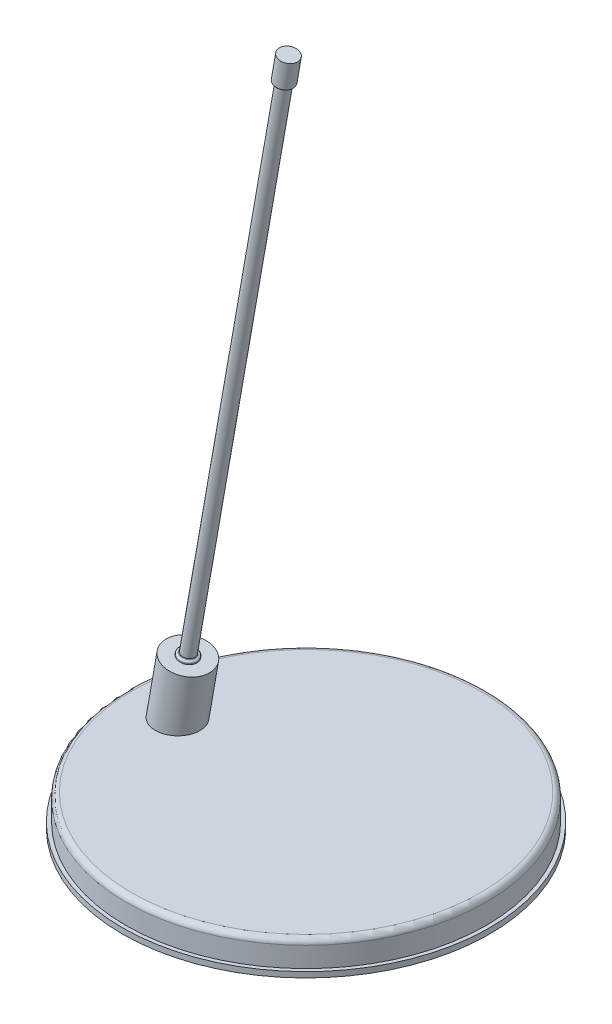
ISO-10303-21;
HEADER;
FILE_DESCRIPTION(('STEP AP214'),'2;1');
FILE_NAME('part.step','',(''),(''),'','','');
FILE_SCHEMA(('AUTOMOTIVE_DESIGN { 1 0 10303 214 1 1 1 1 }'));
ENDSEC;
DATA;
#1=APPLICATION_CONTEXT('core data for automotive mechanical design processes');
#2=APPLICATION_PROTOCOL_DEFINITION('international standard','automotive_design',2000,#1);
#3=PRODUCT_CONTEXT('',#1,'mechanical');
#4=PRODUCT('Part','Part','',(#3));
#5=PRODUCT_RELATED_PRODUCT_CATEGORY('part','',(#4));
#6=PRODUCT_DEFINITION_FORMATION('','',#4);
#7=PRODUCT_DEFINITION_CONTEXT('part definition',#1,'design');
#8=PRODUCT_DEFINITION('design','',#6,#7);
#9=PRODUCT_DEFINITION_SHAPE('','',#8);
#10=(LENGTH_UNIT() NAMED_UNIT(*) SI_UNIT(.MILLI.,.METRE.));
#11=(NAMED_UNIT(*) PLANE_ANGLE_UNIT() SI_UNIT($,.RADIAN.));
#12=(NAMED_UNIT(*) SI_UNIT($,.STERADIAN.) SOLID_ANGLE_UNIT());
#13=UNCERTAINTY_MEASURE_WITH_UNIT(LENGTH_MEASURE(1.E-05),#10,'distance_accuracy_value','');
#14=(GEOMETRIC_REPRESENTATION_CONTEXT(3) GLOBAL_UNCERTAINTY_ASSIGNED_CONTEXT((#13)) GLOBAL_UNIT_ASSIGNED_CONTEXT((#10,
#11,#12)) REPRESENTATION_CONTEXT('',''));
#15=CARTESIAN_POINT('',(0.,0.,0.));
#16=DIRECTION('',(0.,0.,1.));
#17=DIRECTION('',(1.,0.,0.));
#18=AXIS2_PLACEMENT_3D('',#15,#16,#17);
#19=CARTESIAN_POINT('',(0.,8.5,0.));
#20=DIRECTION('',(0.,-1.,0.));
#21=DIRECTION('',(0.,0.,-1.));
#22=AXIS2_PLACEMENT_3D('',#19,#20,#21);
#23=CYLINDRICAL_SURFACE('',#22,49.);
#24=CARTESIAN_POINT('',(0.,7.,0.));
#25=DIRECTION('',(0.,1.,0.));
#26=DIRECTION('',(0.,0.,1.));
#27=AXIS2_PLACEMENT_3D('',#24,#25,#26);
#28=CIRCLE('',#27,49.);
#29=CARTESIAN_POINT('',(0.,7.,49.));
#30=VERTEX_POINT('',#29);
#31=EDGE_CURVE('E71',#30,#30,#28,.F.);
#32=ORIENTED_EDGE('',*,*,#31,.T.);
#33=EDGE_LOOP('',(#32));
#34=FACE_BOUND('',#33,.T.);
#35=CARTESIAN_POINT('',(0.,1.5,0.));
#36=DIRECTION('',(0.,1.,0.));
#37=DIRECTION('',(0.,0.,1.));
#38=AXIS2_PLACEMENT_3D('',#35,#36,#37);
#39=CIRCLE('',#38,49.);
#40=CARTESIAN_POINT('',(0.,1.5,49.));
#41=VERTEX_POINT('',#40);
#42=EDGE_CURVE('E77',#41,#41,#39,.T.);
#43=ORIENTED_EDGE('',*,*,#42,.T.);
#44=EDGE_LOOP('',(#43));
#45=FACE_BOUND('',#44,.T.);
#46=ADVANCED_FACE('F42',(#34,#45),#23,.T.);
#47=CARTESIAN_POINT('',(0.,8.5,0.));
#48=DIRECTION('',(0.,1.,0.));
#49=DIRECTION('',(0.,0.,1.));
#50=AXIS2_PLACEMENT_3D('',#47,#48,#49);
#51=PLANE('',#50);
#52=CARTESIAN_POINT('',(-35.,8.5,0.));
#53=DIRECTION('',(0.,1.,0.));
#54=DIRECTION('',(1.,0.,0.));
#55=AXIS2_PLACEMENT_3D('',#52,#53,#54);
#56=ELLIPSE('',#55,6.09255967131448,6.);
#57=CARTESIAN_POINT('',(-28.9074403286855,8.5,0.));
#58=VERTEX_POINT('',#57);
#59=EDGE_CURVE('E68',#58,#58,#56,.T.);
#60=ORIENTED_EDGE('',*,*,#59,.F.);
#61=EDGE_LOOP('',(#60));
#62=FACE_BOUND('',#61,.T.);
#63=CARTESIAN_POINT('',(0.,8.5,0.));
#64=DIRECTION('',(0.,1.,0.));
#65=DIRECTION('',(0.,0.,1.));
#66=AXIS2_PLACEMENT_3D('',#63,#64,#65);
#67=CIRCLE('',#66,47.5);
#68=CARTESIAN_POINT('',(0.,8.5,47.5));
#69=VERTEX_POINT('',#68);
#70=EDGE_CURVE('E74',#69,#69,#67,.T.);
#71=ORIENTED_EDGE('',*,*,#70,.T.);
#72=EDGE_LOOP('',(#71));
#73=FACE_BOUND('',#72,.T.);
#74=ADVANCED_FACE('F110',(#62,#73),#51,.T.);
#75=CARTESIAN_POINT('',(0.,1.5,0.));
#76=DIRECTION('',(0.,1.,0.));
#77=DIRECTION('',(0.,0.,1.));
#78=AXIS2_PLACEMENT_3D('',#75,#76,#77);
#79=PLANE('',#78);
#80=ORIENTED_EDGE('',*,*,#42,.F.);
#81=EDGE_LOOP('',(#80));
#82=FACE_BOUND('',#81,.T.);
#83=ADVANCED_FACE('F116',(#82),#79,.F.);
#84=CARTESIAN_POINT('',(0.,7.,0.));
#85=DIRECTION('',(0.,1.,0.));
#86=DIRECTION('',(0.,0.,1.));
#87=AXIS2_PLACEMENT_3D('',#84,#85,#86);
#88=TOROIDAL_SURFACE('',#87,47.5,1.5);
#89=ORIENTED_EDGE('',*,*,#31,.F.);
#90=EDGE_LOOP('',(#89));
#91=FACE_BOUND('',#90,.T.);
#92=ORIENTED_EDGE('',*,*,#70,.F.);
#93=EDGE_LOOP('',(#92));
#94=FACE_BOUND('',#93,.T.);
#95=ADVANCED_FACE('F122',(#91,#94),#88,.T.);
#96=CARTESIAN_POINT('',(-37.969637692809,-8.3416522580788,0.));
#97=DIRECTION('',(0.173648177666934,0.984807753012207,0.));
#98=DIRECTION('',(-0.984807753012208,0.173648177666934,0.));
#99=AXIS2_PLACEMENT_3D('',#96,#97,#98);
#100=CYLINDRICAL_SURFACE('',#99,6.);
#101=ORIENTED_EDGE('',*,*,#59,.T.);
#102=EDGE_LOOP('',(#101));
#103=FACE_BOUND('',#102,.T.);
#104=CARTESIAN_POINT('',(-32.1787683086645,24.5,0.));
#105=DIRECTION('',(0.173648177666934,0.984807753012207,0.));
#106=DIRECTION('',(-0.984807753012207,0.173648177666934,0.));
#107=AXIS2_PLACEMENT_3D('',#104,#105,#106);
#108=CIRCLE('',#107,6.);
#109=CARTESIAN_POINT('',(-38.0876148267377,25.5418890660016,0.));
#110=VERTEX_POINT('',#109);
#111=EDGE_CURVE('E80',#110,#110,#108,.T.);
#112=ORIENTED_EDGE('',*,*,#111,.F.);
#113=EDGE_LOOP('',(#112));
#114=FACE_BOUND('',#113,.T.);
#115=ADVANCED_FACE('F125',(#103,#114),#100,.T.);
#116=CARTESIAN_POINT('',(-32.1787683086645,24.5,0.));
#117=DIRECTION('',(0.173648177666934,0.984807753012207,0.));
#118=DIRECTION('',(-0.984807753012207,0.173648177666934,0.));
#119=AXIS2_PLACEMENT_3D('',#116,#117,#118);
#120=PLANE('',#119);
#121=CARTESIAN_POINT('',(-32.1787683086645,24.5,0.));
#122=DIRECTION('',(0.173648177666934,0.984807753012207,0.));
#123=DIRECTION('',(-0.984807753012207,0.173648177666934,0.));
#124=AXIS2_PLACEMENT_3D('',#121,#122,#123);
#125=CIRCLE('',#124,2.5);
#126=CARTESIAN_POINT('',(-34.640787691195,24.9341204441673,0.));
#127=VERTEX_POINT('',#126);
#128=EDGE_CURVE('E83',#127,#127,#125,.T.);
#129=ORIENTED_EDGE('',*,*,#128,.F.);
#130=EDGE_LOOP('',(#129));
#131=FACE_BOUND('',#130,.T.);
#132=ORIENTED_EDGE('',*,*,#111,.T.);
#133=EDGE_LOOP('',(#132));
#134=FACE_BOUND('',#133,.T.);
#135=ADVANCED_FACE('F154',(#131,#134),#120,.T.);
#136=CARTESIAN_POINT('',(-32.039849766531,25.2878462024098,0.));
#137=DIRECTION('',(-0.173648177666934,-0.984807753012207,0.));
#138=DIRECTION('',(0.984807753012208,-0.173648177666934,0.));
#139=AXIS2_PLACEMENT_3D('',#136,#137,#138);
#140=CYLINDRICAL_SURFACE('',#139,2.5);
#141=CARTESIAN_POINT('',(-32.1266738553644,24.7954423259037,0.));
#142=DIRECTION('',(0.173648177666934,0.984807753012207,0.));
#143=DIRECTION('',(-0.984807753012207,0.173648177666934,0.));
#144=AXIS2_PLACEMENT_3D('',#141,#142,#143);
#145=CIRCLE('',#144,2.5);
#146=CARTESIAN_POINT('',(-34.5886932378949,25.229562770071,0.));
#147=VERTEX_POINT('',#146);
#148=EDGE_CURVE('E62',#147,#147,#145,.F.);
#149=ORIENTED_EDGE('',*,*,#148,.T.);
#150=EDGE_LOOP('',(#149));
#151=FACE_BOUND('',#150,.T.);
#152=ORIENTED_EDGE('',*,*,#128,.T.);
#153=EDGE_LOOP('',(#152));
#154=FACE_BOUND('',#153,.T.);
#155=ADVANCED_FACE('F147',(#151,#154),#140,.T.);
#156=CARTESIAN_POINT('',(-32.039849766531,25.2878462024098,0.));
#157=DIRECTION('',(0.173648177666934,0.984807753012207,0.));
#158=DIRECTION('',(-0.984807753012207,0.173648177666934,0.));
#159=AXIS2_PLACEMENT_3D('',#156,#157,#158);
#160=PLANE('',#159);
#161=CARTESIAN_POINT('',(-32.039849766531,25.2878462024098,0.));
#162=DIRECTION('',(0.173648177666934,0.984807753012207,0.));
#163=DIRECTION('',(-0.984807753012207,0.173648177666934,0.));
#164=AXIS2_PLACEMENT_3D('',#161,#162,#163);
#165=CIRCLE('',#164,1.85000000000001);
#166=CARTESIAN_POINT('',(-33.8617441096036,25.6090953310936,0.));
#167=VERTEX_POINT('',#166);
#168=EDGE_CURVE('E53',#167,#167,#165,.F.);
#169=ORIENTED_EDGE('',*,*,#168,.T.);
#170=EDGE_LOOP('',(#169));
#171=FACE_BOUND('',#170,.T.);
#172=CARTESIAN_POINT('',(-32.039849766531,25.2878462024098,0.));
#173=DIRECTION('',(0.173648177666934,0.984807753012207,0.));
#174=DIRECTION('',(-0.984807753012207,0.173648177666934,0.));
#175=AXIS2_PLACEMENT_3D('',#172,#173,#174);
#176=CIRCLE('',#175,2.);
#177=CARTESIAN_POINT('',(-34.0094652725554,25.6351425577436,0.));
#178=VERTEX_POINT('',#177);
#179=EDGE_CURVE('E65',#178,#178,#176,.T.);
#180=ORIENTED_EDGE('',*,*,#179,.T.);
#181=EDGE_LOOP('',(#180));
#182=FACE_BOUND('',#181,.T.);
#183=ADVANCED_FACE('F128',(#171,#182),#160,.T.);
#184=CARTESIAN_POINT('',(-32.1266738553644,24.7954423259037,0.));
#185=DIRECTION('',(0.173648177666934,0.984807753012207,0.));
#186=DIRECTION('',(-0.984807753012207,0.173648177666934,0.));
#187=AXIS2_PLACEMENT_3D('',#184,#185,#186);
#188=TOROIDAL_SURFACE('',#187,2.,0.5);
#189=ORIENTED_EDGE('',*,*,#148,.F.);
#190=EDGE_LOOP('',(#189));
#191=FACE_BOUND('',#190,.T.);
#192=ORIENTED_EDGE('',*,*,#179,.F.);
#193=EDGE_LOOP('',(#192));
#194=FACE_BOUND('',#193,.T.);
#195=ADVANCED_FACE('F105',(#191,#194),#188,.T.);
#196=CARTESIAN_POINT('',(-5.99262311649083,173.009009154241,0.));
#197=DIRECTION('',(-0.173648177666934,-0.984807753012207,0.));
#198=DIRECTION('',(0.984807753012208,-0.173648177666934,0.));
#199=AXIS2_PLACEMENT_3D('',#196,#197,#198);
#200=CYLINDRICAL_SURFACE('',#199,1.75000000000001);
#201=CARTESIAN_POINT('',(-32.0224849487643,25.386326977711,0.));
#202=DIRECTION('',(0.173648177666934,0.984807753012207,0.));
#203=DIRECTION('',(-0.984807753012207,0.173648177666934,0.));
#204=AXIS2_PLACEMENT_3D('',#201,#202,#203);
#205=CIRCLE('',#204,1.75000000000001);
#206=CARTESIAN_POINT('',(-33.7458985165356,25.6902112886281,0.));
#207=VERTEX_POINT('',#206);
#208=EDGE_CURVE('E57',#207,#207,#205,.T.);
#209=ORIENTED_EDGE('',*,*,#208,.T.);
#210=EDGE_LOOP('',(#209));
#211=FACE_BOUND('',#210,.T.);
#212=CARTESIAN_POINT('',(-5.99262311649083,173.009009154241,0.));
#213=DIRECTION('',(0.173648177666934,0.984807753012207,0.));
#214=DIRECTION('',(-0.984807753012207,0.173648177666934,0.));
#215=AXIS2_PLACEMENT_3D('',#212,#213,#214);
#216=CIRCLE('',#215,1.75000000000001);
#217=CARTESIAN_POINT('',(-7.7160366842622,173.312893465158,0.));
#218=VERTEX_POINT('',#217);
#219=EDGE_CURVE('E86',#218,#218,#216,.T.);
#220=ORIENTED_EDGE('',*,*,#219,.F.);
#221=EDGE_LOOP('',(#220));
#222=FACE_BOUND('',#221,.T.);
#223=ADVANCED_FACE('F97',(#211,#222),#200,.T.);
#224=CARTESIAN_POINT('',(-4.77708587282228,179.902663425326,0.));
#225=DIRECTION('',(-0.173648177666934,-0.984807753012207,0.));
#226=DIRECTION('',(0.984807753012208,-0.173648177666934,0.));
#227=AXIS2_PLACEMENT_3D('',#224,#225,#226);
#228=CYLINDRICAL_SURFACE('',#227,2.5);
#229=CARTESIAN_POINT('',(-5.97525829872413,173.107489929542,0.));
#230=DIRECTION('',(0.173648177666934,0.984807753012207,0.));
#231=DIRECTION('',(-0.984807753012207,0.173648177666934,0.));
#232=AXIS2_PLACEMENT_3D('',#229,#230,#231);
#233=CIRCLE('',#232,2.5);
#234=CARTESIAN_POINT('',(-8.43727768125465,173.54161037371,0.));
#235=VERTEX_POINT('',#234);
#236=EDGE_CURVE('E49',#235,#235,#233,.T.);
#237=ORIENTED_EDGE('',*,*,#236,.T.);
#238=EDGE_LOOP('',(#237));
#239=FACE_BOUND('',#238,.T.);
#240=CARTESIAN_POINT('',(-4.77708587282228,179.902663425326,0.));
#241=DIRECTION('',(0.173648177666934,0.984807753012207,0.));
#242=DIRECTION('',(-0.984807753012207,0.173648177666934,0.));
#243=AXIS2_PLACEMENT_3D('',#240,#241,#242);
#244=CIRCLE('',#243,2.5);
#245=CARTESIAN_POINT('',(-7.2391052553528,180.336783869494,0.));
#246=VERTEX_POINT('',#245);
#247=EDGE_CURVE('E89',#246,#246,#244,.T.);
#248=ORIENTED_EDGE('',*,*,#247,.F.);
#249=EDGE_LOOP('',(#248));
#250=FACE_BOUND('',#249,.T.);
#251=ADVANCED_FACE('F95',(#239,#250),#228,.T.);
#252=CARTESIAN_POINT('',(-4.77708587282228,179.902663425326,0.));
#253=DIRECTION('',(0.173648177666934,0.984807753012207,0.));
#254=DIRECTION('',(-0.984807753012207,0.173648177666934,0.));
#255=AXIS2_PLACEMENT_3D('',#252,#253,#254);
#256=PLANE('',#255);
#257=ORIENTED_EDGE('',*,*,#247,.T.);
#258=EDGE_LOOP('',(#257));
#259=FACE_BOUND('',#258,.T.);
#260=ADVANCED_FACE('F93',(#259),#256,.T.);
#261=CARTESIAN_POINT('',(-5.99262311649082,173.009009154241,0.));
#262=DIRECTION('',(0.173648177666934,0.984807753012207,0.));
#263=DIRECTION('',(-0.984807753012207,0.173648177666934,0.));
#264=AXIS2_PLACEMENT_3D('',#261,#262,#263);
#265=PLANE('',#264);
#266=CARTESIAN_POINT('',(-5.99262311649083,173.009009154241,0.));
#267=DIRECTION('',(0.173648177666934,0.984807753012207,0.));
#268=DIRECTION('',(-0.984807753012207,0.173648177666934,0.));
#269=AXIS2_PLACEMENT_3D('',#266,#267,#268);
#270=CIRCLE('',#269,2.4);
#271=CARTESIAN_POINT('',(-8.35616172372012,173.425764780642,0.));
#272=VERTEX_POINT('',#271);
#273=EDGE_CURVE('E11',#272,#272,#270,.F.);
#274=ORIENTED_EDGE('',*,*,#273,.T.);
#275=EDGE_LOOP('',(#274));
#276=FACE_BOUND('',#275,.T.);
#277=ORIENTED_EDGE('',*,*,#219,.T.);
#278=EDGE_LOOP('',(#277));
#279=FACE_BOUND('',#278,.T.);
#280=ADVANCED_FACE('F103',(#276,#279),#265,.F.);
#281=CARTESIAN_POINT('',(-32.0224849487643,25.386326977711,0.));
#282=DIRECTION('',(0.173648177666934,0.984807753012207,0.));
#283=DIRECTION('',(-0.984807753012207,0.173648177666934,0.));
#284=AXIS2_PLACEMENT_3D('',#281,#282,#283);
#285=TOROIDAL_SURFACE('',#284,1.85000000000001,0.1);
#286=ORIENTED_EDGE('',*,*,#168,.F.);
#287=EDGE_LOOP('',(#286));
#288=FACE_BOUND('',#287,.T.);
#289=ORIENTED_EDGE('',*,*,#208,.F.);
#290=EDGE_LOOP('',(#289));
#291=FACE_BOUND('',#290,.T.);
#292=ADVANCED_FACE('F130',(#288,#291),#285,.F.);
#293=CARTESIAN_POINT('',(-5.97525829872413,173.107489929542,0.));
#294=DIRECTION('',(0.173648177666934,0.984807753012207,0.));
#295=DIRECTION('',(-0.984807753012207,0.173648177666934,0.));
#296=AXIS2_PLACEMENT_3D('',#293,#294,#295);
#297=TOROIDAL_SURFACE('',#296,2.4,0.1);
#298=ORIENTED_EDGE('',*,*,#273,.F.);
#299=EDGE_LOOP('',(#298));
#300=FACE_BOUND('',#299,.T.);
#301=ORIENTED_EDGE('',*,*,#236,.F.);
#302=EDGE_LOOP('',(#301));
#303=FACE_BOUND('',#302,.T.);
#304=ADVANCED_FACE('F44',(#300,#303),#297,.T.);
#305=CLOSED_SHELL('',(#46,#74,#83,#95,#115,#135,#155,#183,#195,#223,#251,#260,#280,#292,#304));
#306=MANIFOLD_SOLID_BREP('B2',#305);
#307=CARTESIAN_POINT('',(0.,1.5,0.));
#308=DIRECTION('',(0.,-1.,0.));
#309=DIRECTION('',(0.,0.,-1.));
#310=AXIS2_PLACEMENT_3D('',#307,#308,#309);
#311=CYLINDRICAL_SURFACE('',#310,50.);
#312=CARTESIAN_POINT('',(0.,1.5,0.));
#313=DIRECTION('',(0.,1.,0.));
#314=DIRECTION('',(0.,0.,1.));
#315=AXIS2_PLACEMENT_3D('',#312,#313,#314);
#316=CIRCLE('',#315,50.);
#317=CARTESIAN_POINT('',(0.,1.5,50.));
#318=VERTEX_POINT('',#317);
#319=EDGE_CURVE('E41',#318,#318,#316,.T.);
#320=ORIENTED_EDGE('',*,*,#319,.F.);
#321=EDGE_LOOP('',(#320));
#322=FACE_BOUND('',#321,.T.);
#323=CARTESIAN_POINT('',(0.,0.,0.));
#324=DIRECTION('',(0.,1.,0.));
#325=DIRECTION('',(0.,0.,1.));
#326=AXIS2_PLACEMENT_3D('',#323,#324,#325);
#327=CIRCLE('',#326,50.);
#328=CARTESIAN_POINT('',(0.,0.,50.));
#329=VERTEX_POINT('',#328);
#330=EDGE_CURVE('E266',#329,#329,#327,.T.);
#331=ORIENTED_EDGE('',*,*,#330,.T.);
#332=EDGE_LOOP('',(#331));
#333=FACE_BOUND('',#332,.T.);
#334=ADVANCED_FACE('F263',(#322,#333),#311,.T.);
#335=CARTESIAN_POINT('',(0.,1.5,0.));
#336=DIRECTION('',(0.,1.,0.));
#337=DIRECTION('',(0.,0.,1.));
#338=AXIS2_PLACEMENT_3D('',#335,#336,#337);
#339=PLANE('',#338);
#340=ORIENTED_EDGE('',*,*,#319,.T.);
#341=EDGE_LOOP('',(#340));
#342=FACE_BOUND('',#341,.T.);
#343=ADVANCED_FACE('F278',(#342),#339,.T.);
#344=CARTESIAN_POINT('',(0.,0.,0.));
#345=DIRECTION('',(0.,1.,0.));
#346=DIRECTION('',(0.,0.,1.));
#347=AXIS2_PLACEMENT_3D('',#344,#345,#346);
#348=PLANE('',#347);
#349=ORIENTED_EDGE('',*,*,#330,.F.);
#350=EDGE_LOOP('',(#349));
#351=FACE_BOUND('',#350,.T.);
#352=ADVANCED_FACE('F276',(#351),#348,.F.);
#353=CLOSED_SHELL('',(#334,#343,#352));
#354=MANIFOLD_SOLID_BREP('B6',#353);
#355=ADVANCED_BREP_SHAPE_REPRESENTATION('',(#18,#306,#354),#14);
#356=SHAPE_DEFINITION_REPRESENTATION(#9,#355);
ENDSEC;
END-ISO-10303-21;
